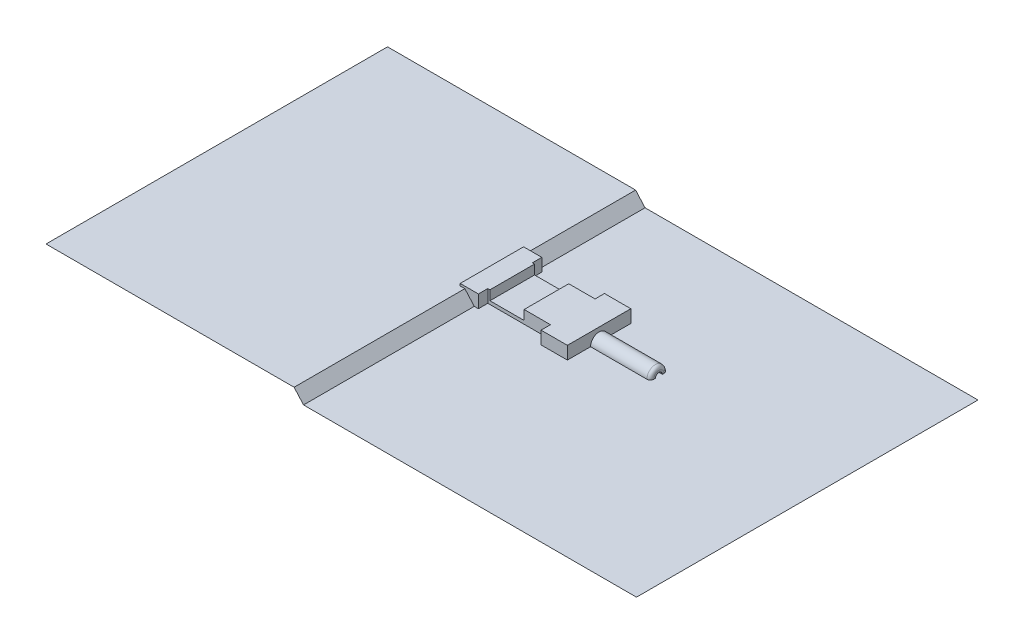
from build123d import *

# Parameters (mm, degrees)
LINEAR_AUSTRAGEN1_DEPTH         = 5
LINEAR_AUSTRAGEN1_DEPTH_BACK    = 10
SKIZZE1_W                       = 81.417330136
SKIZZE1_H                       = 37.139054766
SKIZZE2_W                       = 20.013298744
SKIZZE2_H                       = 5.570466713
SKIZZE2_W_2                     = 13.641351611
SKIZZE2_H_2                     = 3.865297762
SCHNITT_LINEAR_AUSTRAGEN1_DEPTH = 57.004506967
SCHNITT_LINEAR_AUSTRAGEN2_REACH = 49.191
SKIZZE3_W                       = 10.707969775
SKIZZE3_H                       = 17.885796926
SKIZZE3_W_2                     = 36.688056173
SKIZZE3_H_2                     = 5.511523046
SKIZZE4_R                       = 5
LINEAR_AUSTRAGEN2_DEPTH         = 35
SKIZZE6_W                       = 8.942350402
SKIZZE6_H                       = 10
SCHNITT_LINEAR_AUSTRAGEN3_DEPTH = 10
SCHNITT_LINEAR_AUSTRAGEN4_REACH = 120.312
SKIZZE5_R                       = 2
VERRUNDUNG1_R                   = 2
SCHNITT_LINEAR_AUSTRAGEN5_DEPTH = 85.918262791


with BuildPart() as part:
    # Skizze1 → Linear austragen1 (new, two sides: drawn at the far end of the back side and taken through both)
    with BuildSketch(Plane(origin=(0, 0, 0), x_dir=(1, 0, 0), z_dir=(0, 1, 0)).offset(-LINEAR_AUSTRAGEN1_DEPTH_BACK)):
        Rectangle(SKIZZE1_W, SKIZZE1_H)
    extrude(amount=LINEAR_AUSTRAGEN1_DEPTH + LINEAR_AUSTRAGEN1_DEPTH_BACK)

    # Skizze2 → Schnitt-Linear austragen1 (cut, through all)
    with BuildSketch(Plane.XY.offset(18.569527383)):
        Polygon((-40.708665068, 0), (-22.077450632, 0), (-17.949146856, -10), (-40.708665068, -10), align=None)
        with Locations((-0.134618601, 2.214766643)):
            Rectangle(SKIZZE2_W, SKIZZE2_H)
        with Locations((-0.807711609, -8.067351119)):
            Rectangle(SKIZZE2_W_2, SKIZZE2_H_2)
    extrude(amount=-SCHNITT_LINEAR_AUSTRAGEN1_DEPTH, mode=Mode.SUBTRACT)

    # Skizze3 → Schnitt-Linear austragen2 (cut, up to next)
    with BuildSketch(Plane(origin=(0, 5, 0), x_dir=(-1, 0, 0), z_dir=(0, 1, 0)), mode=Mode.PRIVATE) as schnitt_linear_austragen2_sk1:
        with Locations((29.546547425, 0)):
            Rectangle(SKIZZE3_W, SKIZZE3_H)
    schnitt_linear_austragen2_tool1 = extrude(schnitt_linear_austragen2_sk1.sketch, amount=-SCHNITT_LINEAR_AUSTRAGEN2_REACH, mode=Mode.PRIVATE) & part.part
    # Skizze3 → Schnitt-Linear austragen2 (cut, up to next)
    with BuildSketch(Plane(origin=(0, 5, 0), x_dir=(-1, 0, 0), z_dir=(0, 1, 0)), mode=Mode.PRIVATE) as schnitt_linear_austragen2_sk2:
        with Locations((-6.946319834, 15.81376586)):
            Rectangle(SKIZZE3_W_2, SKIZZE3_H_2)
    schnitt_linear_austragen2_tool2 = extrude(schnitt_linear_austragen2_sk2.sketch, amount=-SCHNITT_LINEAR_AUSTRAGEN2_REACH, mode=Mode.PRIVATE) & part.part
    # Skizze3 → Schnitt-Linear austragen2 (cut, up to next)
    with BuildSketch(Plane(origin=(0, 5, 0), x_dir=(-1, 0, 0), z_dir=(0, 1, 0)), mode=Mode.PRIVATE) as schnitt_linear_austragen2_sk3:
        with Locations((-6.946319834, -15.81376586)):
            Rectangle(SKIZZE3_W_2, SKIZZE3_H_2)
    schnitt_linear_austragen2_tool3 = extrude(schnitt_linear_austragen2_sk3.sketch, amount=-SCHNITT_LINEAR_AUSTRAGEN2_REACH, mode=Mode.PRIVATE) & part.part
    add(schnitt_linear_austragen2_tool1.solids().sort_by_distance((-29.546547, 5, 0))[0], mode=Mode.SUBTRACT)
    add(schnitt_linear_austragen2_tool2.solids().sort_by_distance((6.94632, 5, 15.813766))[0], mode=Mode.SUBTRACT)
    add(schnitt_linear_austragen2_tool3.solids().sort_by_distance((6.94632, 5, -15.813766))[0], mode=Mode.SUBTRACT)

    # Skizze4 → Linear austragen2 (add)
    with BuildSketch(Plane(origin=(40.708665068, 0, 0), x_dir=(0, 0, -1), z_dir=(1, 0, 0))):
        with Locations(Location((0, -2.5, 0), (0, 0, 180))):
            Circle(SKIZZE4_R)
    extrude(amount=LINEAR_AUSTRAGEN2_DEPTH)

    # Skizze6 → Schnitt-Linear austragen3 (cut)
    with BuildSketch(Plane.XZ.offset(10)):
        with Locations((33.237489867, 0)):
            Rectangle(SKIZZE6_W, SKIZZE6_H)
    extrude(amount=-SCHNITT_LINEAR_AUSTRAGEN3_DEPTH, mode=Mode.SUBTRACT)

    # Skizze5 → Schnitt-Linear austragen4 (cut, up to next)
    with BuildSketch(Plane(origin=(75.708665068, 0, 0), x_dir=(0, 0, -1), z_dir=(1, 0, 0)), mode=Mode.PRIVATE) as schnitt_linear_austragen4_sk1:
        with Locations((0, -2.5)):
            Circle(SKIZZE5_R)
    schnitt_linear_austragen4_tool1 = extrude(schnitt_linear_austragen4_sk1.sketch, amount=-SCHNITT_LINEAR_AUSTRAGEN4_REACH, mode=Mode.PRIVATE) & part.part
    add(schnitt_linear_austragen4_tool1.solids().sort_by_distance((75.708665, -2.5, 0))[0], mode=Mode.SUBTRACT)

    # Verrundung1
    verrundung1_edges = [part.edges().sort_by_distance(p)[0] for p in [
        (75.708665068, -2.5, -5),
    ]]
    fillet(verrundung1_edges, radius=VERRUNDUNG1_R)

    # Skizze8 → Schnitt-Linear austragen5 (cut, through all)
    with BuildSketch(Plane.XY.offset(18.569527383)):
        Polygon((-285.155569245, 3.723810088), (-40.708665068, 3.723810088), (-22.077450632, 3.723810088), (-22.077450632, 5), (-22.077450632, 249.446904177), (-355.791795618, 606.730953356), (-618.869914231, 361.007859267), align=None)
    extrude(amount=-SCHNITT_LINEAR_AUSTRAGEN5_DEPTH, mode=Mode.SUBTRACT)


solid = part.part
